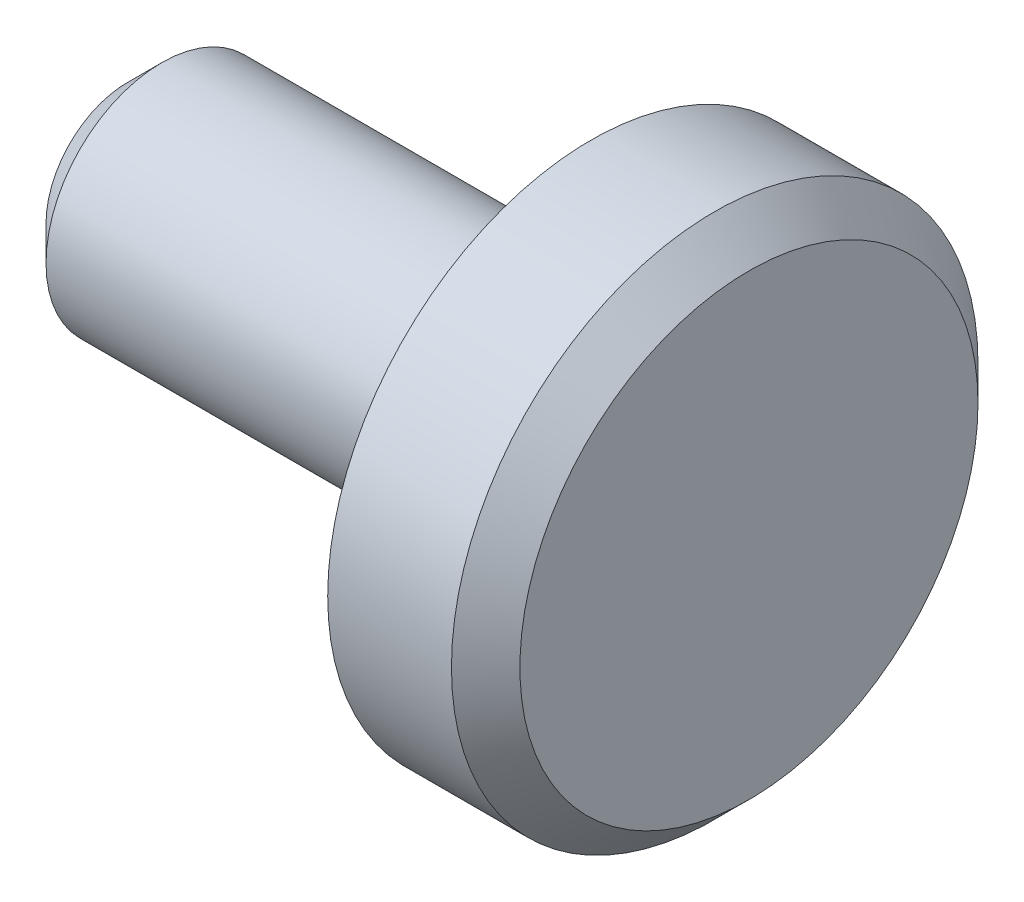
from build123d import *

# Parameters (mm, degrees)
CHAMFER1_SIZE = 0.8255


with BuildPart() as part:
    # Sketch1 → Revolve1 (revolve)
    with BuildSketch(Plane.XY, mode=Mode.PRIVATE) as revolve1_sk:
        Polygon((0, 0), (-14.986, 0), (-14.986, 2.794), (-3.81, 2.794), (-3.81, 6.35), (0, 6.35), align=None)
    revolve(revolve1_sk.sketch.rotate(Axis((0, 0, 0), (-1, 0, 0)), 90), axis=Axis((0, 0, 0), (-1, 0, 0)))

    # Chamfer1
    chamfer1_edges = [part.edges().sort_by_distance(p)[0] for p in [
        (0, 0, 6.35),
        (-14.986, 0, 2.794),
    ]]
    chamfer(chamfer1_edges, length=CHAMFER1_SIZE)


solid = part.part
